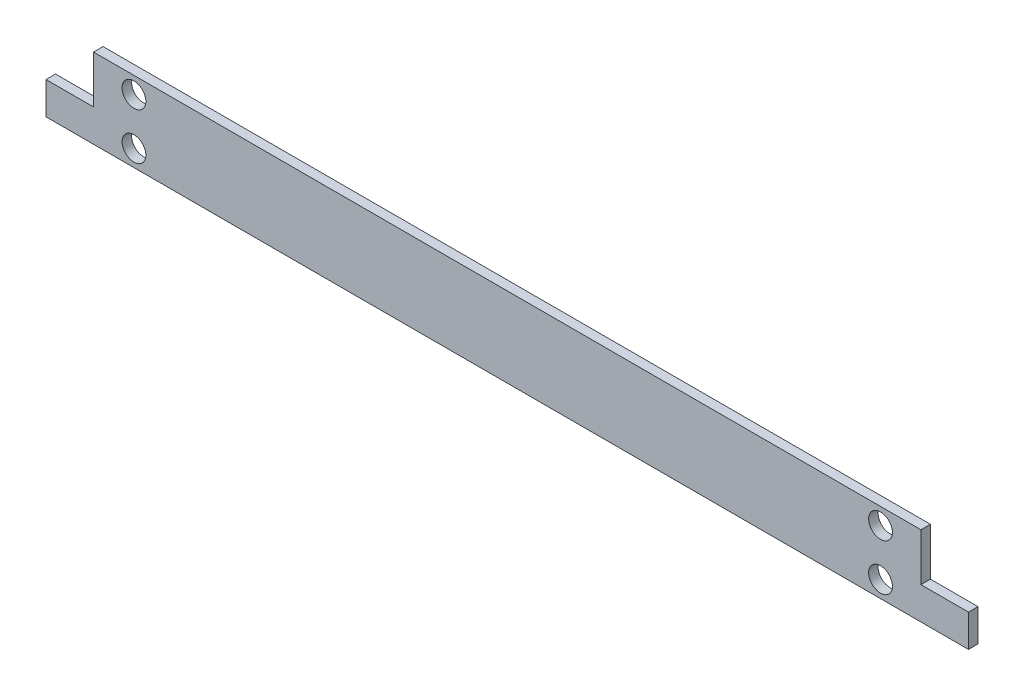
from build123d import *

# Parameters (mm, degrees)
SKETCH1_R           = 3.175
BOSS_EXTRUDE1_DEPTH = 2.54


with BuildPart() as part:
    # Sketch1 → Boss-Extrude1 (new body)
    with BuildSketch(Plane.XY):
        Polygon((0, 8.636), (0, 0), (246.38, 0), (246.38, 8.636), (233.68, 8.636), (233.68, 21.336), (12.7, 21.336), (12.7, 8.636), align=None)
        with Locations((23.495, 4.445)):
            Circle(SKETCH1_R, mode=Mode.SUBTRACT)
        with Locations((222.885, 4.445)):
            Circle(SKETCH1_R, mode=Mode.SUBTRACT)
        with Locations((23.495, 16.891)):
            Circle(SKETCH1_R, mode=Mode.SUBTRACT)
        with Locations((222.885, 16.891)):
            Circle(SKETCH1_R, mode=Mode.SUBTRACT)
    extrude(amount=BOSS_EXTRUDE1_DEPTH)


solid = part.part
